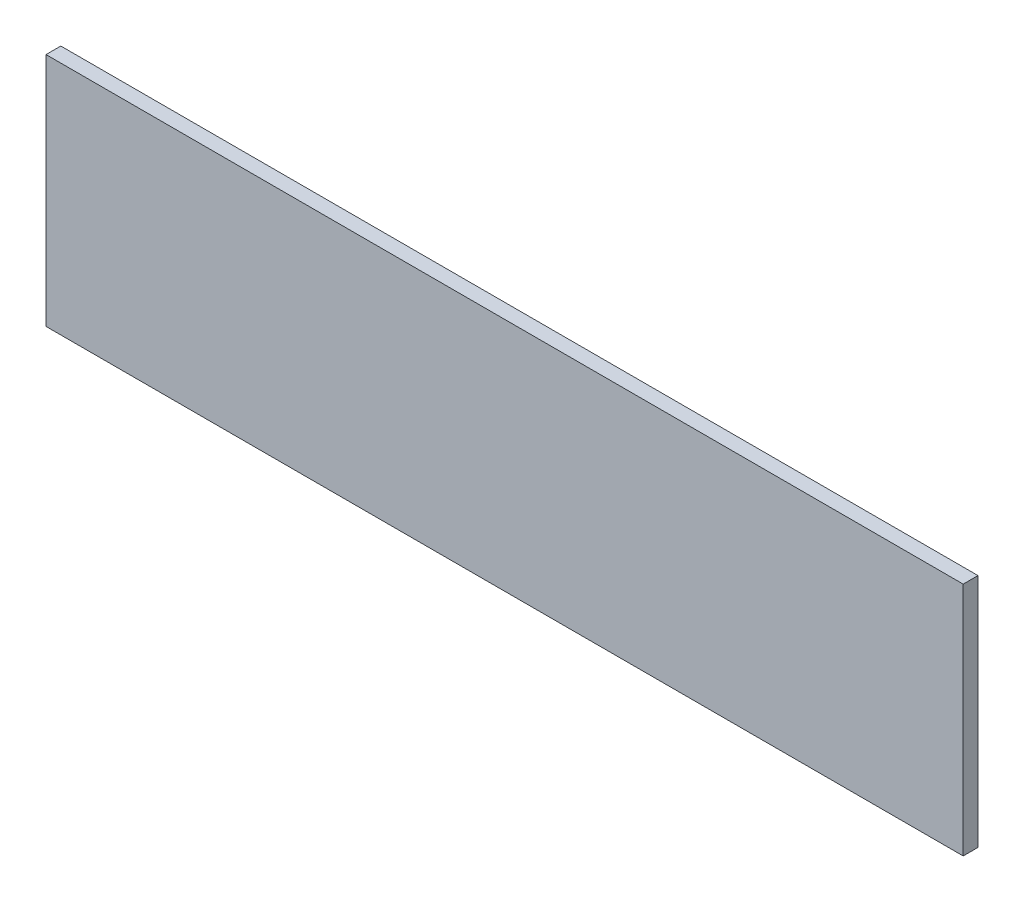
from build123d import *

# Parameters (mm, degrees)
SKETCH1_W      = 1181.1
SKETCH1_H      = 303.2125
EXTRUDE1_DEPTH = 9.525


with BuildPart() as part:
    # Sketch1 → Extrude1 (new, symmetric)
    with BuildSketch(Plane.XY):
        Rectangle(SKETCH1_W, SKETCH1_H)
    extrude(amount=EXTRUDE1_DEPTH, both=True)


solid = part.part
